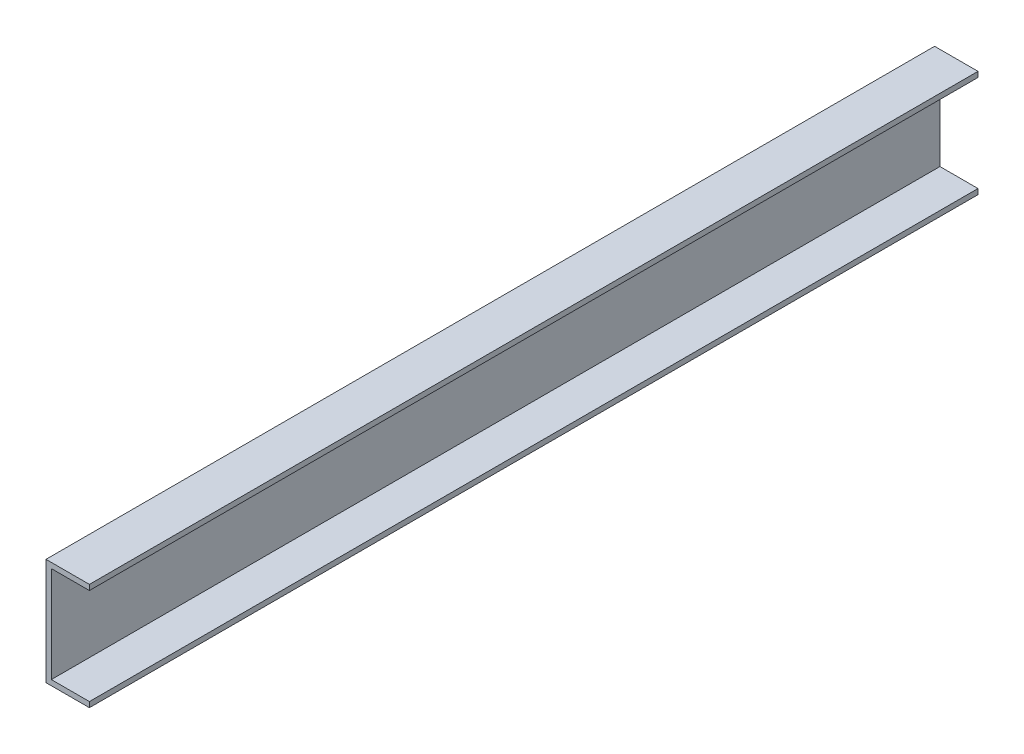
ISO-10303-21;
HEADER;
FILE_DESCRIPTION(('STEP AP214'),'2;1');
FILE_NAME('part.step','',(''),(''),'','','');
FILE_SCHEMA(('AUTOMOTIVE_DESIGN { 1 0 10303 214 1 1 1 1 }'));
ENDSEC;
DATA;
#1=APPLICATION_CONTEXT('core data for automotive mechanical design processes');
#2=APPLICATION_PROTOCOL_DEFINITION('international standard','automotive_design',2000,#1);
#3=PRODUCT_CONTEXT('',#1,'mechanical');
#4=PRODUCT('Part','Part','',(#3));
#5=PRODUCT_RELATED_PRODUCT_CATEGORY('part','',(#4));
#6=PRODUCT_DEFINITION_FORMATION('','',#4);
#7=PRODUCT_DEFINITION_CONTEXT('part definition',#1,'design');
#8=PRODUCT_DEFINITION('design','',#6,#7);
#9=PRODUCT_DEFINITION_SHAPE('','',#8);
#10=(LENGTH_UNIT() NAMED_UNIT(*) SI_UNIT(.MILLI.,.METRE.));
#11=(NAMED_UNIT(*) PLANE_ANGLE_UNIT() SI_UNIT($,.RADIAN.));
#12=(NAMED_UNIT(*) SI_UNIT($,.STERADIAN.) SOLID_ANGLE_UNIT());
#13=UNCERTAINTY_MEASURE_WITH_UNIT(LENGTH_MEASURE(1.E-05),#10,'distance_accuracy_value','');
#14=(GEOMETRIC_REPRESENTATION_CONTEXT(3) GLOBAL_UNCERTAINTY_ASSIGNED_CONTEXT((#13)) GLOBAL_UNIT_ASSIGNED_CONTEXT((#10,
#11,#12)) REPRESENTATION_CONTEXT('',''));
#15=CARTESIAN_POINT('',(0.,0.,0.));
#16=DIRECTION('',(0.,0.,1.));
#17=DIRECTION('',(1.,0.,0.));
#18=AXIS2_PLACEMENT_3D('',#15,#16,#17);
#19=CARTESIAN_POINT('',(65.,8.,1331.));
#20=DIRECTION('',(-1.,0.,0.));
#21=DIRECTION('',(0.,0.,1.));
#22=AXIS2_PLACEMENT_3D('',#19,#20,#21);
#23=PLANE('',#22);
#24=DIRECTION('',(0.,1.,0.));
#25=VECTOR('',#24,1.);
#26=CARTESIAN_POINT('',(65.,8.,0.));
#27=LINE('',#26,#25);
#28=CARTESIAN_POINT('',(65.,0.,0.));
#29=VERTEX_POINT('',#28);
#30=CARTESIAN_POINT('',(65.,8.,0.));
#31=VERTEX_POINT('',#30);
#32=EDGE_CURVE('E128',#29,#31,#27,.T.);
#33=ORIENTED_EDGE('',*,*,#32,.T.);
#34=DIRECTION('',(0.,0.,-1.));
#35=VECTOR('',#34,1.);
#36=CARTESIAN_POINT('',(65.,8.,1331.));
#37=LINE('',#36,#35);
#38=CARTESIAN_POINT('',(65.,8.,1331.));
#39=VERTEX_POINT('',#38);
#40=EDGE_CURVE('E11',#39,#31,#37,.T.);
#41=ORIENTED_EDGE('',*,*,#40,.F.);
#42=DIRECTION('',(0.,1.,0.));
#43=VECTOR('',#42,1.);
#44=CARTESIAN_POINT('',(65.,8.,1331.));
#45=LINE('',#44,#43);
#46=CARTESIAN_POINT('',(65.,0.,1331.));
#47=VERTEX_POINT('',#46);
#48=EDGE_CURVE('E142',#47,#39,#45,.T.);
#49=ORIENTED_EDGE('',*,*,#48,.F.);
#50=DIRECTION('',(0.,0.,-1.));
#51=VECTOR('',#50,1.);
#52=CARTESIAN_POINT('',(65.,0.,1331.));
#53=LINE('',#52,#51);
#54=EDGE_CURVE('E124',#47,#29,#53,.T.);
#55=ORIENTED_EDGE('',*,*,#54,.T.);
#56=EDGE_LOOP('',(#33,#41,#49,#55));
#57=FACE_BOUND('',#56,.T.);
#58=ADVANCED_FACE('F32',(#57),#23,.F.);
#59=CARTESIAN_POINT('',(8.00000000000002,8.,1331.));
#60=DIRECTION('',(0.,-1.,0.));
#61=DIRECTION('',(0.,0.,-1.));
#62=AXIS2_PLACEMENT_3D('',#59,#60,#61);
#63=PLANE('',#62);
#64=DIRECTION('',(-1.,0.,0.));
#65=VECTOR('',#64,1.);
#66=CARTESIAN_POINT('',(8.00000000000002,8.,0.));
#67=LINE('',#66,#65);
#68=CARTESIAN_POINT('',(8.00000000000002,8.,0.));
#69=VERTEX_POINT('',#68);
#70=EDGE_CURVE('E131',#31,#69,#67,.T.);
#71=ORIENTED_EDGE('',*,*,#70,.T.);
#72=DIRECTION('',(0.,0.,-1.));
#73=VECTOR('',#72,1.);
#74=CARTESIAN_POINT('',(8.00000000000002,8.,1331.));
#75=LINE('',#74,#73);
#76=CARTESIAN_POINT('',(8.00000000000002,8.,1331.));
#77=VERTEX_POINT('',#76);
#78=EDGE_CURVE('E40',#77,#69,#75,.T.);
#79=ORIENTED_EDGE('',*,*,#78,.F.);
#80=DIRECTION('',(-1.,0.,0.));
#81=VECTOR('',#80,1.);
#82=CARTESIAN_POINT('',(8.00000000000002,8.,1331.));
#83=LINE('',#82,#81);
#84=EDGE_CURVE('E91',#39,#77,#83,.T.);
#85=ORIENTED_EDGE('',*,*,#84,.F.);
#86=ORIENTED_EDGE('',*,*,#40,.T.);
#87=EDGE_LOOP('',(#71,#79,#85,#86));
#88=FACE_BOUND('',#87,.T.);
#89=ADVANCED_FACE('F177',(#88),#63,.F.);
#90=CARTESIAN_POINT('',(8.,152.,1331.));
#91=DIRECTION('',(-1.,0.,0.));
#92=DIRECTION('',(0.,-1.,0.));
#93=AXIS2_PLACEMENT_3D('',#90,#91,#92);
#94=PLANE('',#93);
#95=DIRECTION('',(0.,1.,0.));
#96=VECTOR('',#95,1.);
#97=CARTESIAN_POINT('',(8.,152.,0.));
#98=LINE('',#97,#96);
#99=CARTESIAN_POINT('',(8.,152.,0.));
#100=VERTEX_POINT('',#99);
#101=EDGE_CURVE('E133',#69,#100,#98,.T.);
#102=ORIENTED_EDGE('',*,*,#101,.T.);
#103=DIRECTION('',(0.,0.,-1.));
#104=VECTOR('',#103,1.);
#105=CARTESIAN_POINT('',(8.,152.,1331.));
#106=LINE('',#105,#104);
#107=CARTESIAN_POINT('',(8.,152.,1331.));
#108=VERTEX_POINT('',#107);
#109=EDGE_CURVE('E149',#108,#100,#106,.T.);
#110=ORIENTED_EDGE('',*,*,#109,.F.);
#111=DIRECTION('',(0.,1.,0.));
#112=VECTOR('',#111,1.);
#113=CARTESIAN_POINT('',(8.,152.,1331.));
#114=LINE('',#113,#112);
#115=EDGE_CURVE('E157',#77,#108,#114,.T.);
#116=ORIENTED_EDGE('',*,*,#115,.F.);
#117=ORIENTED_EDGE('',*,*,#78,.T.);
#118=EDGE_LOOP('',(#102,#110,#116,#117));
#119=FACE_BOUND('',#118,.T.);
#120=ADVANCED_FACE('F155',(#119),#94,.F.);
#121=CARTESIAN_POINT('',(65.,152.,1331.));
#122=DIRECTION('',(0.,1.,0.));
#123=DIRECTION('',(0.,0.,1.));
#124=AXIS2_PLACEMENT_3D('',#121,#122,#123);
#125=PLANE('',#124);
#126=DIRECTION('',(1.,0.,0.));
#127=VECTOR('',#126,1.);
#128=CARTESIAN_POINT('',(65.,152.,0.));
#129=LINE('',#128,#127);
#130=CARTESIAN_POINT('',(65.,152.,0.));
#131=VERTEX_POINT('',#130);
#132=EDGE_CURVE('E135',#100,#131,#129,.T.);
#133=ORIENTED_EDGE('',*,*,#132,.T.);
#134=DIRECTION('',(0.,0.,-1.));
#135=VECTOR('',#134,1.);
#136=CARTESIAN_POINT('',(65.,152.,1331.));
#137=LINE('',#136,#135);
#138=CARTESIAN_POINT('',(65.,152.,1331.));
#139=VERTEX_POINT('',#138);
#140=EDGE_CURVE('E146',#139,#131,#137,.T.);
#141=ORIENTED_EDGE('',*,*,#140,.F.);
#142=DIRECTION('',(1.,0.,0.));
#143=VECTOR('',#142,1.);
#144=CARTESIAN_POINT('',(65.,152.,1331.));
#145=LINE('',#144,#143);
#146=EDGE_CURVE('E169',#108,#139,#145,.T.);
#147=ORIENTED_EDGE('',*,*,#146,.F.);
#148=ORIENTED_EDGE('',*,*,#109,.T.);
#149=EDGE_LOOP('',(#133,#141,#147,#148));
#150=FACE_BOUND('',#149,.T.);
#151=ADVANCED_FACE('F165',(#150),#125,.F.);
#152=CARTESIAN_POINT('',(65.,160.,1331.));
#153=DIRECTION('',(-1.,0.,0.));
#154=DIRECTION('',(0.,-1.,0.));
#155=AXIS2_PLACEMENT_3D('',#152,#153,#154);
#156=PLANE('',#155);
#157=DIRECTION('',(0.,1.,0.));
#158=VECTOR('',#157,1.);
#159=CARTESIAN_POINT('',(65.,160.,0.));
#160=LINE('',#159,#158);
#161=CARTESIAN_POINT('',(65.,160.,0.));
#162=VERTEX_POINT('',#161);
#163=EDGE_CURVE('E137',#131,#162,#160,.T.);
#164=ORIENTED_EDGE('',*,*,#163,.T.);
#165=DIRECTION('',(0.,0.,-1.));
#166=VECTOR('',#165,1.);
#167=CARTESIAN_POINT('',(65.,160.,1331.));
#168=LINE('',#167,#166);
#169=CARTESIAN_POINT('',(65.,160.,1331.));
#170=VERTEX_POINT('',#169);
#171=EDGE_CURVE('E119',#170,#162,#168,.T.);
#172=ORIENTED_EDGE('',*,*,#171,.F.);
#173=DIRECTION('',(0.,1.,0.));
#174=VECTOR('',#173,1.);
#175=CARTESIAN_POINT('',(65.,160.,1331.));
#176=LINE('',#175,#174);
#177=EDGE_CURVE('E110',#139,#170,#176,.T.);
#178=ORIENTED_EDGE('',*,*,#177,.F.);
#179=ORIENTED_EDGE('',*,*,#140,.T.);
#180=EDGE_LOOP('',(#164,#172,#178,#179));
#181=FACE_BOUND('',#180,.T.);
#182=ADVANCED_FACE('F168',(#181),#156,.F.);
#183=CARTESIAN_POINT('',(0.,160.,1331.));
#184=DIRECTION('',(0.,-1.,0.));
#185=DIRECTION('',(0.,0.,-1.));
#186=AXIS2_PLACEMENT_3D('',#183,#184,#185);
#187=PLANE('',#186);
#188=DIRECTION('',(-1.,0.,0.));
#189=VECTOR('',#188,1.);
#190=CARTESIAN_POINT('',(0.,160.,0.));
#191=LINE('',#190,#189);
#192=CARTESIAN_POINT('',(0.,160.,0.));
#193=VERTEX_POINT('',#192);
#194=EDGE_CURVE('E118',#162,#193,#191,.T.);
#195=ORIENTED_EDGE('',*,*,#194,.T.);
#196=DIRECTION('',(0.,0.,-1.));
#197=VECTOR('',#196,1.);
#198=CARTESIAN_POINT('',(0.,160.,1331.));
#199=LINE('',#198,#197);
#200=CARTESIAN_POINT('',(0.,160.,1331.));
#201=VERTEX_POINT('',#200);
#202=EDGE_CURVE('E115',#201,#193,#199,.T.);
#203=ORIENTED_EDGE('',*,*,#202,.F.);
#204=DIRECTION('',(-1.,0.,0.));
#205=VECTOR('',#204,1.);
#206=CARTESIAN_POINT('',(0.,160.,1331.));
#207=LINE('',#206,#205);
#208=EDGE_CURVE('E104',#170,#201,#207,.T.);
#209=ORIENTED_EDGE('',*,*,#208,.F.);
#210=ORIENTED_EDGE('',*,*,#171,.T.);
#211=EDGE_LOOP('',(#195,#203,#209,#210));
#212=FACE_BOUND('',#211,.T.);
#213=ADVANCED_FACE('F116',(#212),#187,.F.);
#214=CARTESIAN_POINT('',(0.,0.,1331.));
#215=DIRECTION('',(1.,0.,0.));
#216=DIRECTION('',(0.,0.,-1.));
#217=AXIS2_PLACEMENT_3D('',#214,#215,#216);
#218=PLANE('',#217);
#219=DIRECTION('',(0.,-1.,0.));
#220=VECTOR('',#219,1.);
#221=CARTESIAN_POINT('',(0.,0.,0.));
#222=LINE('',#221,#220);
#223=CARTESIAN_POINT('',(0.,0.,0.));
#224=VERTEX_POINT('',#223);
#225=EDGE_CURVE('E77',#193,#224,#222,.T.);
#226=ORIENTED_EDGE('',*,*,#225,.T.);
#227=DIRECTION('',(0.,0.,-1.));
#228=VECTOR('',#227,1.);
#229=CARTESIAN_POINT('',(0.,0.,1331.));
#230=LINE('',#229,#228);
#231=CARTESIAN_POINT('',(0.,0.,1331.));
#232=VERTEX_POINT('',#231);
#233=EDGE_CURVE('E120',#232,#224,#230,.T.);
#234=ORIENTED_EDGE('',*,*,#233,.F.);
#235=DIRECTION('',(0.,-1.,0.));
#236=VECTOR('',#235,1.);
#237=CARTESIAN_POINT('',(0.,0.,1331.));
#238=LINE('',#237,#236);
#239=EDGE_CURVE('E108',#201,#232,#238,.T.);
#240=ORIENTED_EDGE('',*,*,#239,.F.);
#241=ORIENTED_EDGE('',*,*,#202,.T.);
#242=EDGE_LOOP('',(#226,#234,#240,#241));
#243=FACE_BOUND('',#242,.T.);
#244=ADVANCED_FACE('F122',(#243),#218,.F.);
#245=CARTESIAN_POINT('',(65.,0.,1331.));
#246=DIRECTION('',(0.,1.,0.));
#247=DIRECTION('',(-1.,0.,0.));
#248=AXIS2_PLACEMENT_3D('',#245,#246,#247);
#249=PLANE('',#248);
#250=DIRECTION('',(1.,0.,0.));
#251=VECTOR('',#250,1.);
#252=CARTESIAN_POINT('',(65.,0.,0.));
#253=LINE('',#252,#251);
#254=EDGE_CURVE('E83',#224,#29,#253,.T.);
#255=ORIENTED_EDGE('',*,*,#254,.T.);
#256=ORIENTED_EDGE('',*,*,#54,.F.);
#257=DIRECTION('',(1.,0.,0.));
#258=VECTOR('',#257,1.);
#259=CARTESIAN_POINT('',(65.,0.,1331.));
#260=LINE('',#259,#258);
#261=EDGE_CURVE('E48',#232,#47,#260,.T.);
#262=ORIENTED_EDGE('',*,*,#261,.F.);
#263=ORIENTED_EDGE('',*,*,#233,.T.);
#264=EDGE_LOOP('',(#255,#256,#262,#263));
#265=FACE_BOUND('',#264,.T.);
#266=ADVANCED_FACE('F193',(#265),#249,.F.);
#267=CARTESIAN_POINT('',(0.,0.,1331.));
#268=DIRECTION('',(0.,0.,-1.));
#269=DIRECTION('',(-1.,0.,0.));
#270=AXIS2_PLACEMENT_3D('',#267,#268,#269);
#271=PLANE('',#270);
#272=ORIENTED_EDGE('',*,*,#48,.T.);
#273=ORIENTED_EDGE('',*,*,#84,.T.);
#274=ORIENTED_EDGE('',*,*,#115,.T.);
#275=ORIENTED_EDGE('',*,*,#146,.T.);
#276=ORIENTED_EDGE('',*,*,#177,.T.);
#277=ORIENTED_EDGE('',*,*,#208,.T.);
#278=ORIENTED_EDGE('',*,*,#239,.T.);
#279=ORIENTED_EDGE('',*,*,#261,.T.);
#280=EDGE_LOOP('',(#272,#273,#274,#275,#276,#277,#278,#279));
#281=FACE_BOUND('',#280,.T.);
#282=ADVANCED_FACE('F106',(#281),#271,.F.);
#283=CARTESIAN_POINT('',(0.,0.,0.));
#284=DIRECTION('',(0.,0.,-1.));
#285=DIRECTION('',(-1.,0.,0.));
#286=AXIS2_PLACEMENT_3D('',#283,#284,#285);
#287=PLANE('',#286);
#288=ORIENTED_EDGE('',*,*,#32,.F.);
#289=ORIENTED_EDGE('',*,*,#254,.F.);
#290=ORIENTED_EDGE('',*,*,#225,.F.);
#291=ORIENTED_EDGE('',*,*,#194,.F.);
#292=ORIENTED_EDGE('',*,*,#163,.F.);
#293=ORIENTED_EDGE('',*,*,#132,.F.);
#294=ORIENTED_EDGE('',*,*,#101,.F.);
#295=ORIENTED_EDGE('',*,*,#70,.F.);
#296=EDGE_LOOP('',(#288,#289,#290,#291,#292,#293,#294,#295));
#297=FACE_BOUND('',#296,.T.);
#298=ADVANCED_FACE('F161',(#297),#287,.T.);
#299=CLOSED_SHELL('',(#58,#89,#120,#151,#182,#213,#244,#266,#282,#298));
#300=MANIFOLD_SOLID_BREP('B2',#299);
#301=ADVANCED_BREP_SHAPE_REPRESENTATION('',(#18,#300),#14);
#302=SHAPE_DEFINITION_REPRESENTATION(#9,#301);
ENDSEC;
END-ISO-10303-21;
